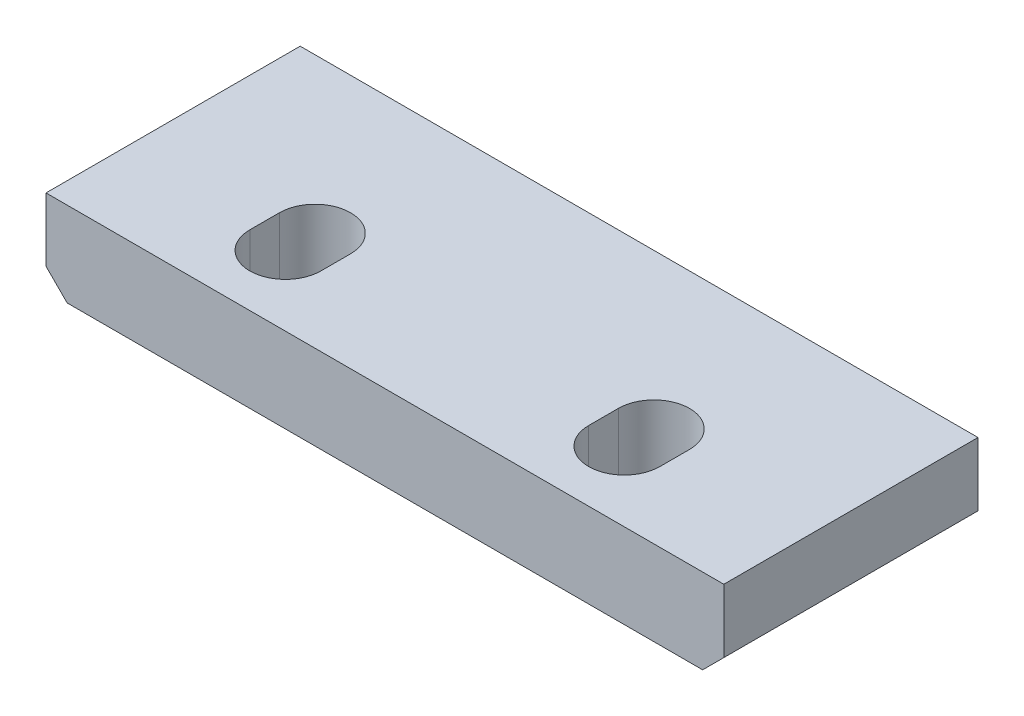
ISO-10303-21;
HEADER;
FILE_DESCRIPTION(('STEP AP214'),'2;1');
FILE_NAME('part.step','',(''),(''),'','','');
FILE_SCHEMA(('AUTOMOTIVE_DESIGN { 1 0 10303 214 1 1 1 1 }'));
ENDSEC;
DATA;
#1=APPLICATION_CONTEXT('core data for automotive mechanical design processes');
#2=APPLICATION_PROTOCOL_DEFINITION('international standard','automotive_design',2000,#1);
#3=PRODUCT_CONTEXT('',#1,'mechanical');
#4=PRODUCT('Part','Part','',(#3));
#5=PRODUCT_RELATED_PRODUCT_CATEGORY('part','',(#4));
#6=PRODUCT_DEFINITION_FORMATION('','',#4);
#7=PRODUCT_DEFINITION_CONTEXT('part definition',#1,'design');
#8=PRODUCT_DEFINITION('design','',#6,#7);
#9=PRODUCT_DEFINITION_SHAPE('','',#8);
#10=(LENGTH_UNIT() NAMED_UNIT(*) SI_UNIT(.MILLI.,.METRE.));
#11=(NAMED_UNIT(*) PLANE_ANGLE_UNIT() SI_UNIT($,.RADIAN.));
#12=(NAMED_UNIT(*) SI_UNIT($,.STERADIAN.) SOLID_ANGLE_UNIT());
#13=UNCERTAINTY_MEASURE_WITH_UNIT(LENGTH_MEASURE(1.E-05),#10,'distance_accuracy_value','');
#14=(GEOMETRIC_REPRESENTATION_CONTEXT(3) GLOBAL_UNCERTAINTY_ASSIGNED_CONTEXT((#13)) GLOBAL_UNIT_ASSIGNED_CONTEXT((#10,
#11,#12)) REPRESENTATION_CONTEXT('',''));
#15=CARTESIAN_POINT('',(0.,0.,0.));
#16=DIRECTION('',(0.,0.,1.));
#17=DIRECTION('',(1.,0.,0.));
#18=AXIS2_PLACEMENT_3D('',#15,#16,#17);
#19=CARTESIAN_POINT('',(0.,6.35,0.));
#20=DIRECTION('',(0.,1.,0.));
#21=DIRECTION('',(0.,0.,1.));
#22=AXIS2_PLACEMENT_3D('',#19,#20,#21);
#23=PLANE('',#22);
#24=CARTESIAN_POINT('',(-12.7,6.35,4.28610602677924));
#25=DIRECTION('',(0.,-1.,0.));
#26=DIRECTION('',(0.,0.,-1.));
#27=AXIS2_PLACEMENT_3D('',#24,#25,#26);
#28=CIRCLE('',#27,2.667);
#29=CARTESIAN_POINT('',(-10.033,6.35,4.28610602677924));
#30=VERTEX_POINT('',#29);
#31=CARTESIAN_POINT('',(-15.367,6.35,4.28610602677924));
#32=VERTEX_POINT('',#31);
#33=EDGE_CURVE('E177',#30,#32,#28,.T.);
#34=ORIENTED_EDGE('',*,*,#33,.T.);
#35=DIRECTION('',(0.,0.,-1.));
#36=VECTOR('',#35,1.);
#37=CARTESIAN_POINT('',(-15.367,6.35,4.28610602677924));
#38=LINE('',#37,#36);
#39=CARTESIAN_POINT('',(-15.367,6.35,2.06389397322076));
#40=VERTEX_POINT('',#39);
#41=EDGE_CURVE('E180',#32,#40,#38,.T.);
#42=ORIENTED_EDGE('',*,*,#41,.T.);
#43=CARTESIAN_POINT('',(-12.7,6.35,2.06389397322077));
#44=DIRECTION('',(0.,-1.,0.));
#45=DIRECTION('',(0.,0.,-1.));
#46=AXIS2_PLACEMENT_3D('',#43,#44,#45);
#47=CIRCLE('',#46,2.667);
#48=CARTESIAN_POINT('',(-10.033,6.35,2.06389397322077));
#49=VERTEX_POINT('',#48);
#50=EDGE_CURVE('E183',#40,#49,#47,.T.);
#51=ORIENTED_EDGE('',*,*,#50,.T.);
#52=DIRECTION('',(0.,0.,1.));
#53=VECTOR('',#52,1.);
#54=CARTESIAN_POINT('',(-10.033,6.35,4.28610602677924));
#55=LINE('',#54,#53);
#56=EDGE_CURVE('E186',#49,#30,#55,.T.);
#57=ORIENTED_EDGE('',*,*,#56,.T.);
#58=EDGE_LOOP('',(#34,#42,#51,#57));
#59=FACE_BOUND('',#58,.T.);
#60=DIRECTION('',(0.,0.,1.));
#61=VECTOR('',#60,1.);
#62=CARTESIAN_POINT('',(-25.4,6.35,9.525));
#63=LINE('',#62,#61);
#64=CARTESIAN_POINT('',(-25.4,6.35,-9.525));
#65=VERTEX_POINT('',#64);
#66=CARTESIAN_POINT('',(-25.4,6.35,9.525));
#67=VERTEX_POINT('',#66);
#68=EDGE_CURVE('E206',#65,#67,#63,.T.);
#69=ORIENTED_EDGE('',*,*,#68,.T.);
#70=DIRECTION('',(1.,0.,0.));
#71=VECTOR('',#70,1.);
#72=CARTESIAN_POINT('',(25.4,6.35,9.525));
#73=LINE('',#72,#71);
#74=CARTESIAN_POINT('',(25.4,6.35,9.525));
#75=VERTEX_POINT('',#74);
#76=EDGE_CURVE('E209',#67,#75,#73,.T.);
#77=ORIENTED_EDGE('',*,*,#76,.T.);
#78=DIRECTION('',(0.,0.,-1.));
#79=VECTOR('',#78,1.);
#80=CARTESIAN_POINT('',(25.4,6.35,9.525));
#81=LINE('',#80,#79);
#82=CARTESIAN_POINT('',(25.4,6.35,-9.525));
#83=VERTEX_POINT('',#82);
#84=EDGE_CURVE('E212',#75,#83,#81,.T.);
#85=ORIENTED_EDGE('',*,*,#84,.T.);
#86=DIRECTION('',(-1.,0.,0.));
#87=VECTOR('',#86,1.);
#88=CARTESIAN_POINT('',(25.4,6.35,-9.525));
#89=LINE('',#88,#87);
#90=EDGE_CURVE('E214',#83,#65,#89,.T.);
#91=ORIENTED_EDGE('',*,*,#90,.T.);
#92=EDGE_LOOP('',(#69,#77,#85,#91));
#93=FACE_BOUND('',#92,.T.);
#94=CARTESIAN_POINT('',(12.7,6.35,2.06389397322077));
#95=DIRECTION('',(0.,1.,0.));
#96=DIRECTION('',(0.,0.,-1.));
#97=AXIS2_PLACEMENT_3D('',#94,#95,#96);
#98=CIRCLE('',#97,2.667);
#99=CARTESIAN_POINT('',(15.367,6.35,2.06389397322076));
#100=VERTEX_POINT('',#99);
#101=CARTESIAN_POINT('',(10.033,6.35,2.06389397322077));
#102=VERTEX_POINT('',#101);
#103=EDGE_CURVE('E147',#100,#102,#98,.T.);
#104=ORIENTED_EDGE('',*,*,#103,.F.);
#105=DIRECTION('',(0.,0.,-1.));
#106=VECTOR('',#105,1.);
#107=CARTESIAN_POINT('',(15.367,6.35,4.28610602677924));
#108=LINE('',#107,#106);
#109=CARTESIAN_POINT('',(15.367,6.35,4.28610602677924));
#110=VERTEX_POINT('',#109);
#111=EDGE_CURVE('E156',#110,#100,#108,.T.);
#112=ORIENTED_EDGE('',*,*,#111,.F.);
#113=CARTESIAN_POINT('',(12.7,6.35,4.28610602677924));
#114=DIRECTION('',(0.,1.,0.));
#115=DIRECTION('',(0.,0.,-1.));
#116=AXIS2_PLACEMENT_3D('',#113,#114,#115);
#117=CIRCLE('',#116,2.667);
#118=CARTESIAN_POINT('',(10.033,6.35,4.28610602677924));
#119=VERTEX_POINT('',#118);
#120=EDGE_CURVE('E148',#119,#110,#117,.T.);
#121=ORIENTED_EDGE('',*,*,#120,.F.);
#122=DIRECTION('',(0.,0.,1.));
#123=VECTOR('',#122,1.);
#124=CARTESIAN_POINT('',(10.033,6.35,4.28610602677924));
#125=LINE('',#124,#123);
#126=EDGE_CURVE('E53',#102,#119,#125,.T.);
#127=ORIENTED_EDGE('',*,*,#126,.F.);
#128=EDGE_LOOP('',(#104,#112,#121,#127));
#129=FACE_BOUND('',#128,.T.);
#130=ADVANCED_FACE('F38',(#59,#93,#129),#23,.T.);
#131=CARTESIAN_POINT('',(0.,0.,0.));
#132=DIRECTION('',(0.,1.,0.));
#133=DIRECTION('',(0.,0.,1.));
#134=AXIS2_PLACEMENT_3D('',#131,#132,#133);
#135=PLANE('',#134);
#136=DIRECTION('',(-1.,0.,0.));
#137=VECTOR('',#136,1.);
#138=CARTESIAN_POINT('',(25.4,0.,-9.525));
#139=LINE('',#138,#137);
#140=CARTESIAN_POINT('',(23.8125,0.,-9.525));
#141=VERTEX_POINT('',#140);
#142=CARTESIAN_POINT('',(-23.8125,0.,-9.525));
#143=VERTEX_POINT('',#142);
#144=EDGE_CURVE('E210',#141,#143,#139,.T.);
#145=ORIENTED_EDGE('',*,*,#144,.F.);
#146=DIRECTION('',(0.,0.,1.));
#147=VECTOR('',#146,1.);
#148=CARTESIAN_POINT('',(23.8125,0.,0.));
#149=LINE('',#148,#147);
#150=CARTESIAN_POINT('',(23.8125,0.,9.525));
#151=VERTEX_POINT('',#150);
#152=EDGE_CURVE('E241',#141,#151,#149,.T.);
#153=ORIENTED_EDGE('',*,*,#152,.T.);
#154=DIRECTION('',(1.,0.,0.));
#155=VECTOR('',#154,1.);
#156=CARTESIAN_POINT('',(25.4,0.,9.525));
#157=LINE('',#156,#155);
#158=CARTESIAN_POINT('',(-23.8125,0.,9.525));
#159=VERTEX_POINT('',#158);
#160=EDGE_CURVE('E198',#159,#151,#157,.T.);
#161=ORIENTED_EDGE('',*,*,#160,.F.);
#162=DIRECTION('',(0.,0.,-1.));
#163=VECTOR('',#162,1.);
#164=CARTESIAN_POINT('',(-23.8125,0.,0.));
#165=LINE('',#164,#163);
#166=EDGE_CURVE('E239',#159,#143,#165,.T.);
#167=ORIENTED_EDGE('',*,*,#166,.T.);
#168=EDGE_LOOP('',(#145,#153,#161,#167));
#169=FACE_BOUND('',#168,.T.);
#170=DIRECTION('',(0.,0.,-1.));
#171=VECTOR('',#170,1.);
#172=CARTESIAN_POINT('',(-15.367,0.,4.28610602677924));
#173=LINE('',#172,#171);
#174=CARTESIAN_POINT('',(-15.367,0.,4.28610602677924));
#175=VERTEX_POINT('',#174);
#176=CARTESIAN_POINT('',(-15.367,0.,2.06389397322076));
#177=VERTEX_POINT('',#176);
#178=EDGE_CURVE('E190',#175,#177,#173,.T.);
#179=ORIENTED_EDGE('',*,*,#178,.F.);
#180=CARTESIAN_POINT('',(-12.7,0.,4.28610602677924));
#181=DIRECTION('',(0.,-1.,0.));
#182=DIRECTION('',(0.,0.,-1.));
#183=AXIS2_PLACEMENT_3D('',#180,#181,#182);
#184=CIRCLE('',#183,2.667);
#185=CARTESIAN_POINT('',(-10.033,0.,4.28610602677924));
#186=VERTEX_POINT('',#185);
#187=EDGE_CURVE('E61',#186,#175,#184,.T.);
#188=ORIENTED_EDGE('',*,*,#187,.F.);
#189=DIRECTION('',(0.,0.,1.));
#190=VECTOR('',#189,1.);
#191=CARTESIAN_POINT('',(-10.033,0.,4.28610602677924));
#192=LINE('',#191,#190);
#193=CARTESIAN_POINT('',(-10.033,0.,2.06389397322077));
#194=VERTEX_POINT('',#193);
#195=EDGE_CURVE('E181',#194,#186,#192,.T.);
#196=ORIENTED_EDGE('',*,*,#195,.F.);
#197=CARTESIAN_POINT('',(-12.7,0.,2.06389397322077));
#198=DIRECTION('',(0.,-1.,0.));
#199=DIRECTION('',(0.,0.,-1.));
#200=AXIS2_PLACEMENT_3D('',#197,#198,#199);
#201=CIRCLE('',#200,2.667);
#202=EDGE_CURVE('E192',#177,#194,#201,.T.);
#203=ORIENTED_EDGE('',*,*,#202,.F.);
#204=EDGE_LOOP('',(#179,#188,#196,#203));
#205=FACE_BOUND('',#204,.T.);
#206=DIRECTION('',(0.,0.,-1.));
#207=VECTOR('',#206,1.);
#208=CARTESIAN_POINT('',(15.367,0.,4.28610602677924));
#209=LINE('',#208,#207);
#210=CARTESIAN_POINT('',(15.367,0.,4.28610602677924));
#211=VERTEX_POINT('',#210);
#212=CARTESIAN_POINT('',(15.367,0.,2.06389397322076));
#213=VERTEX_POINT('',#212);
#214=EDGE_CURVE('E159',#211,#213,#209,.T.);
#215=ORIENTED_EDGE('',*,*,#214,.T.);
#216=CARTESIAN_POINT('',(12.7,0.,2.06389397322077));
#217=DIRECTION('',(0.,1.,0.));
#218=DIRECTION('',(0.,0.,-1.));
#219=AXIS2_PLACEMENT_3D('',#216,#217,#218);
#220=CIRCLE('',#219,2.667);
#221=CARTESIAN_POINT('',(10.033,0.,2.06389397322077));
#222=VERTEX_POINT('',#221);
#223=EDGE_CURVE('E161',#213,#222,#220,.T.);
#224=ORIENTED_EDGE('',*,*,#223,.T.);
#225=DIRECTION('',(0.,0.,1.));
#226=VECTOR('',#225,1.);
#227=CARTESIAN_POINT('',(10.033,0.,4.28610602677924));
#228=LINE('',#227,#226);
#229=CARTESIAN_POINT('',(10.033,0.,4.28610602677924));
#230=VERTEX_POINT('',#229);
#231=EDGE_CURVE('E167',#222,#230,#228,.T.);
#232=ORIENTED_EDGE('',*,*,#231,.T.);
#233=CARTESIAN_POINT('',(12.7,0.,4.28610602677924));
#234=DIRECTION('',(0.,1.,0.));
#235=DIRECTION('',(0.,0.,-1.));
#236=AXIS2_PLACEMENT_3D('',#233,#234,#235);
#237=CIRCLE('',#236,2.667);
#238=EDGE_CURVE('E155',#230,#211,#237,.T.);
#239=ORIENTED_EDGE('',*,*,#238,.T.);
#240=EDGE_LOOP('',(#215,#224,#232,#239));
#241=FACE_BOUND('',#240,.T.);
#242=ADVANCED_FACE('F263',(#169,#205,#241),#135,.F.);
#243=CARTESIAN_POINT('',(-25.4,6.35,9.525));
#244=DIRECTION('',(1.,0.,0.));
#245=DIRECTION('',(0.,0.,-1.));
#246=AXIS2_PLACEMENT_3D('',#243,#244,#245);
#247=PLANE('',#246);
#248=DIRECTION('',(0.,-1.,0.));
#249=VECTOR('',#248,1.);
#250=CARTESIAN_POINT('',(-25.4,6.35,-9.525));
#251=LINE('',#250,#249);
#252=CARTESIAN_POINT('',(-25.4,1.5875,-9.525));
#253=VERTEX_POINT('',#252);
#254=EDGE_CURVE('E216',#65,#253,#251,.T.);
#255=ORIENTED_EDGE('',*,*,#254,.T.);
#256=DIRECTION('',(0.,0.,1.));
#257=VECTOR('',#256,1.);
#258=CARTESIAN_POINT('',(-25.4,1.5875,9.525));
#259=LINE('',#258,#257);
#260=CARTESIAN_POINT('',(-25.4,1.5875,9.525));
#261=VERTEX_POINT('',#260);
#262=EDGE_CURVE('E11',#253,#261,#259,.T.);
#263=ORIENTED_EDGE('',*,*,#262,.T.);
#264=DIRECTION('',(0.,-1.,0.));
#265=VECTOR('',#264,1.);
#266=CARTESIAN_POINT('',(-25.4,6.35,9.525));
#267=LINE('',#266,#265);
#268=EDGE_CURVE('E229',#67,#261,#267,.T.);
#269=ORIENTED_EDGE('',*,*,#268,.F.);
#270=ORIENTED_EDGE('',*,*,#68,.F.);
#271=EDGE_LOOP('',(#255,#263,#269,#270));
#272=FACE_BOUND('',#271,.T.);
#273=ADVANCED_FACE('F271',(#272),#247,.F.);
#274=CARTESIAN_POINT('',(25.4,6.35,9.525));
#275=DIRECTION('',(0.,0.,-1.));
#276=DIRECTION('',(-1.,0.,0.));
#277=AXIS2_PLACEMENT_3D('',#274,#275,#276);
#278=PLANE('',#277);
#279=ORIENTED_EDGE('',*,*,#160,.T.);
#280=DIRECTION('',(-0.707106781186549,-0.707106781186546,0.));
#281=VECTOR('',#280,1.);
#282=CARTESIAN_POINT('',(25.4,1.5875,9.525));
#283=LINE('',#282,#281);
#284=CARTESIAN_POINT('',(25.4,1.5875,9.525));
#285=VERTEX_POINT('',#284);
#286=EDGE_CURVE('E46',#151,#285,#283,.F.);
#287=ORIENTED_EDGE('',*,*,#286,.T.);
#288=DIRECTION('',(0.,-1.,0.));
#289=VECTOR('',#288,1.);
#290=CARTESIAN_POINT('',(25.4,6.35,9.525));
#291=LINE('',#290,#289);
#292=EDGE_CURVE('E226',#75,#285,#291,.T.);
#293=ORIENTED_EDGE('',*,*,#292,.F.);
#294=ORIENTED_EDGE('',*,*,#76,.F.);
#295=ORIENTED_EDGE('',*,*,#268,.T.);
#296=DIRECTION('',(-0.707106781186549,0.707106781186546,0.));
#297=VECTOR('',#296,1.);
#298=CARTESIAN_POINT('',(-25.4,1.5875,9.525));
#299=LINE('',#298,#297);
#300=EDGE_CURVE('E243',#261,#159,#299,.F.);
#301=ORIENTED_EDGE('',*,*,#300,.T.);
#302=EDGE_LOOP('',(#279,#287,#293,#294,#295,#301));
#303=FACE_BOUND('',#302,.T.);
#304=ADVANCED_FACE('F247',(#303),#278,.F.);
#305=CARTESIAN_POINT('',(25.4,6.35,9.525));
#306=DIRECTION('',(-1.,0.,0.));
#307=DIRECTION('',(0.,0.,1.));
#308=AXIS2_PLACEMENT_3D('',#305,#306,#307);
#309=PLANE('',#308);
#310=ORIENTED_EDGE('',*,*,#292,.T.);
#311=DIRECTION('',(0.,0.,-1.));
#312=VECTOR('',#311,1.);
#313=CARTESIAN_POINT('',(25.4,1.5875,9.525));
#314=LINE('',#313,#312);
#315=CARTESIAN_POINT('',(25.4,1.5875,-9.525));
#316=VERTEX_POINT('',#315);
#317=EDGE_CURVE('E232',#285,#316,#314,.T.);
#318=ORIENTED_EDGE('',*,*,#317,.T.);
#319=DIRECTION('',(0.,-1.,0.));
#320=VECTOR('',#319,1.);
#321=CARTESIAN_POINT('',(25.4,6.35,-9.525));
#322=LINE('',#321,#320);
#323=EDGE_CURVE('E223',#83,#316,#322,.T.);
#324=ORIENTED_EDGE('',*,*,#323,.F.);
#325=ORIENTED_EDGE('',*,*,#84,.F.);
#326=EDGE_LOOP('',(#310,#318,#324,#325));
#327=FACE_BOUND('',#326,.T.);
#328=ADVANCED_FACE('F254',(#327),#309,.F.);
#329=CARTESIAN_POINT('',(25.4,6.35,-9.525));
#330=DIRECTION('',(0.,0.,1.));
#331=DIRECTION('',(1.,0.,0.));
#332=AXIS2_PLACEMENT_3D('',#329,#330,#331);
#333=PLANE('',#332);
#334=ORIENTED_EDGE('',*,*,#323,.T.);
#335=DIRECTION('',(0.707106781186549,0.707106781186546,0.));
#336=VECTOR('',#335,1.);
#337=CARTESIAN_POINT('',(25.4,1.5875,-9.525));
#338=LINE('',#337,#336);
#339=EDGE_CURVE('E237',#316,#141,#338,.F.);
#340=ORIENTED_EDGE('',*,*,#339,.T.);
#341=ORIENTED_EDGE('',*,*,#144,.T.);
#342=DIRECTION('',(0.707106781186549,-0.707106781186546,0.));
#343=VECTOR('',#342,1.);
#344=CARTESIAN_POINT('',(-25.4,1.5875,-9.52499999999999));
#345=LINE('',#344,#343);
#346=EDGE_CURVE('E235',#143,#253,#345,.F.);
#347=ORIENTED_EDGE('',*,*,#346,.T.);
#348=ORIENTED_EDGE('',*,*,#254,.F.);
#349=ORIENTED_EDGE('',*,*,#90,.F.);
#350=EDGE_LOOP('',(#334,#340,#341,#347,#348,#349));
#351=FACE_BOUND('',#350,.T.);
#352=ADVANCED_FACE('F259',(#351),#333,.F.);
#353=CARTESIAN_POINT('',(25.4,1.5875,9.525));
#354=DIRECTION('',(-0.707106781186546,0.707106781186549,0.));
#355=DIRECTION('',(0.,0.,-1.));
#356=AXIS2_PLACEMENT_3D('',#353,#354,#355);
#357=PLANE('',#356);
#358=ORIENTED_EDGE('',*,*,#286,.F.);
#359=ORIENTED_EDGE('',*,*,#152,.F.);
#360=ORIENTED_EDGE('',*,*,#339,.F.);
#361=ORIENTED_EDGE('',*,*,#317,.F.);
#362=EDGE_LOOP('',(#358,#359,#360,#361));
#363=FACE_BOUND('',#362,.T.);
#364=ADVANCED_FACE('F256',(#363),#357,.F.);
#365=CARTESIAN_POINT('',(-25.4,1.5875,9.525));
#366=DIRECTION('',(0.707106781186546,0.707106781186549,0.));
#367=DIRECTION('',(0.,0.,1.));
#368=AXIS2_PLACEMENT_3D('',#365,#366,#367);
#369=PLANE('',#368);
#370=ORIENTED_EDGE('',*,*,#346,.F.);
#371=ORIENTED_EDGE('',*,*,#166,.F.);
#372=ORIENTED_EDGE('',*,*,#300,.F.);
#373=ORIENTED_EDGE('',*,*,#262,.F.);
#374=EDGE_LOOP('',(#370,#371,#372,#373));
#375=FACE_BOUND('',#374,.T.);
#376=ADVANCED_FACE('F40',(#375),#369,.F.);
#377=CARTESIAN_POINT('',(-10.033,6.35,4.28610602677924));
#378=DIRECTION('',(1.,0.,0.));
#379=DIRECTION('',(0.,0.,-1.));
#380=AXIS2_PLACEMENT_3D('',#377,#378,#379);
#381=PLANE('',#380);
#382=ORIENTED_EDGE('',*,*,#56,.F.);
#383=DIRECTION('',(0.,-1.,0.));
#384=VECTOR('',#383,1.);
#385=CARTESIAN_POINT('',(-10.033,6.35,2.06389397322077));
#386=LINE('',#385,#384);
#387=EDGE_CURVE('E199',#49,#194,#386,.T.);
#388=ORIENTED_EDGE('',*,*,#387,.T.);
#389=ORIENTED_EDGE('',*,*,#195,.T.);
#390=DIRECTION('',(0.,-1.,0.));
#391=VECTOR('',#390,1.);
#392=CARTESIAN_POINT('',(-10.033,6.35,4.28610602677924));
#393=LINE('',#392,#391);
#394=EDGE_CURVE('E196',#30,#186,#393,.T.);
#395=ORIENTED_EDGE('',*,*,#394,.F.);
#396=EDGE_LOOP('',(#382,#388,#389,#395));
#397=FACE_BOUND('',#396,.T.);
#398=ADVANCED_FACE('F296',(#397),#381,.F.);
#399=CARTESIAN_POINT('',(-15.367,6.35,4.28610602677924));
#400=DIRECTION('',(-1.,0.,0.));
#401=DIRECTION('',(0.,0.,1.));
#402=AXIS2_PLACEMENT_3D('',#399,#400,#401);
#403=PLANE('',#402);
#404=ORIENTED_EDGE('',*,*,#41,.F.);
#405=DIRECTION('',(0.,-1.,0.));
#406=VECTOR('',#405,1.);
#407=CARTESIAN_POINT('',(-15.367,6.35,4.28610602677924));
#408=LINE('',#407,#406);
#409=EDGE_CURVE('E188',#32,#175,#408,.T.);
#410=ORIENTED_EDGE('',*,*,#409,.T.);
#411=ORIENTED_EDGE('',*,*,#178,.T.);
#412=DIRECTION('',(0.,-1.,0.));
#413=VECTOR('',#412,1.);
#414=CARTESIAN_POINT('',(-15.367,6.35,2.06389397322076));
#415=LINE('',#414,#413);
#416=EDGE_CURVE('E202',#40,#177,#415,.T.);
#417=ORIENTED_EDGE('',*,*,#416,.F.);
#418=EDGE_LOOP('',(#404,#410,#411,#417));
#419=FACE_BOUND('',#418,.T.);
#420=ADVANCED_FACE('F300',(#419),#403,.F.);
#421=CARTESIAN_POINT('',(-12.7,6.35,4.28610602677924));
#422=DIRECTION('',(0.,-1.,0.));
#423=DIRECTION('',(0.,0.,-1.));
#424=AXIS2_PLACEMENT_3D('',#421,#422,#423);
#425=CYLINDRICAL_SURFACE('',#424,2.667);
#426=ORIENTED_EDGE('',*,*,#187,.T.);
#427=ORIENTED_EDGE('',*,*,#409,.F.);
#428=ORIENTED_EDGE('',*,*,#33,.F.);
#429=ORIENTED_EDGE('',*,*,#394,.T.);
#430=EDGE_LOOP('',(#426,#427,#428,#429));
#431=FACE_BOUND('',#430,.T.);
#432=ADVANCED_FACE('F282',(#431),#425,.F.);
#433=CARTESIAN_POINT('',(-12.7,6.35,2.06389397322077));
#434=DIRECTION('',(0.,-1.,0.));
#435=DIRECTION('',(0.,0.,-1.));
#436=AXIS2_PLACEMENT_3D('',#433,#434,#435);
#437=CYLINDRICAL_SURFACE('',#436,2.667);
#438=ORIENTED_EDGE('',*,*,#202,.T.);
#439=ORIENTED_EDGE('',*,*,#387,.F.);
#440=ORIENTED_EDGE('',*,*,#50,.F.);
#441=ORIENTED_EDGE('',*,*,#416,.T.);
#442=EDGE_LOOP('',(#438,#439,#440,#441));
#443=FACE_BOUND('',#442,.T.);
#444=ADVANCED_FACE('F311',(#443),#437,.F.);
#445=CARTESIAN_POINT('',(15.367,6.35,4.28610602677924));
#446=DIRECTION('',(-1.,0.,0.));
#447=DIRECTION('',(0.,0.,1.));
#448=AXIS2_PLACEMENT_3D('',#445,#446,#447);
#449=PLANE('',#448);
#450=ORIENTED_EDGE('',*,*,#111,.T.);
#451=DIRECTION('',(0.,-1.,0.));
#452=VECTOR('',#451,1.);
#453=CARTESIAN_POINT('',(15.367,6.35,2.06389397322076));
#454=LINE('',#453,#452);
#455=EDGE_CURVE('E173',#100,#213,#454,.T.);
#456=ORIENTED_EDGE('',*,*,#455,.T.);
#457=ORIENTED_EDGE('',*,*,#214,.F.);
#458=DIRECTION('',(0.,-1.,0.));
#459=VECTOR('',#458,1.);
#460=CARTESIAN_POINT('',(15.367,6.35,4.28610602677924));
#461=LINE('',#460,#459);
#462=EDGE_CURVE('E171',#110,#211,#461,.T.);
#463=ORIENTED_EDGE('',*,*,#462,.F.);
#464=EDGE_LOOP('',(#450,#456,#457,#463));
#465=FACE_BOUND('',#464,.T.);
#466=ADVANCED_FACE('F313',(#465),#449,.T.);
#467=CARTESIAN_POINT('',(10.033,6.35,4.28610602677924));
#468=DIRECTION('',(1.,0.,0.));
#469=DIRECTION('',(0.,0.,-1.));
#470=AXIS2_PLACEMENT_3D('',#467,#468,#469);
#471=PLANE('',#470);
#472=DIRECTION('',(0.,-1.,0.));
#473=VECTOR('',#472,1.);
#474=CARTESIAN_POINT('',(10.033,6.35,2.06389397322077));
#475=LINE('',#474,#473);
#476=EDGE_CURVE('E145',#102,#222,#475,.T.);
#477=ORIENTED_EDGE('',*,*,#476,.F.);
#478=ORIENTED_EDGE('',*,*,#126,.T.);
#479=DIRECTION('',(0.,-1.,0.));
#480=VECTOR('',#479,1.);
#481=CARTESIAN_POINT('',(10.033,6.35,4.28610602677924));
#482=LINE('',#481,#480);
#483=EDGE_CURVE('E143',#119,#230,#482,.T.);
#484=ORIENTED_EDGE('',*,*,#483,.T.);
#485=ORIENTED_EDGE('',*,*,#231,.F.);
#486=EDGE_LOOP('',(#477,#478,#484,#485));
#487=FACE_BOUND('',#486,.T.);
#488=ADVANCED_FACE('F141',(#487),#471,.T.);
#489=CARTESIAN_POINT('',(12.7,6.35,4.28610602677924));
#490=DIRECTION('',(0.,-1.,0.));
#491=DIRECTION('',(0.,0.,-1.));
#492=AXIS2_PLACEMENT_3D('',#489,#490,#491);
#493=CYLINDRICAL_SURFACE('',#492,2.667);
#494=ORIENTED_EDGE('',*,*,#238,.F.);
#495=ORIENTED_EDGE('',*,*,#483,.F.);
#496=ORIENTED_EDGE('',*,*,#120,.T.);
#497=ORIENTED_EDGE('',*,*,#462,.T.);
#498=EDGE_LOOP('',(#494,#495,#496,#497));
#499=FACE_BOUND('',#498,.T.);
#500=ADVANCED_FACE('F151',(#499),#493,.F.);
#501=CARTESIAN_POINT('',(12.7,6.35,2.06389397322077));
#502=DIRECTION('',(0.,-1.,0.));
#503=DIRECTION('',(0.,0.,-1.));
#504=AXIS2_PLACEMENT_3D('',#501,#502,#503);
#505=CYLINDRICAL_SURFACE('',#504,2.667);
#506=ORIENTED_EDGE('',*,*,#223,.F.);
#507=ORIENTED_EDGE('',*,*,#455,.F.);
#508=ORIENTED_EDGE('',*,*,#103,.T.);
#509=ORIENTED_EDGE('',*,*,#476,.T.);
#510=EDGE_LOOP('',(#506,#507,#508,#509));
#511=FACE_BOUND('',#510,.T.);
#512=ADVANCED_FACE('F332',(#511),#505,.F.);
#513=CLOSED_SHELL('',(#130,#242,#273,#304,#328,#352,#364,#376,#398,#420,#432,#444,#466,#488,
#500,#512));
#514=MANIFOLD_SOLID_BREP('B2',#513);
#515=ADVANCED_BREP_SHAPE_REPRESENTATION('',(#18,#514),#14);
#516=SHAPE_DEFINITION_REPRESENTATION(#9,#515);
ENDSEC;
END-ISO-10303-21;
